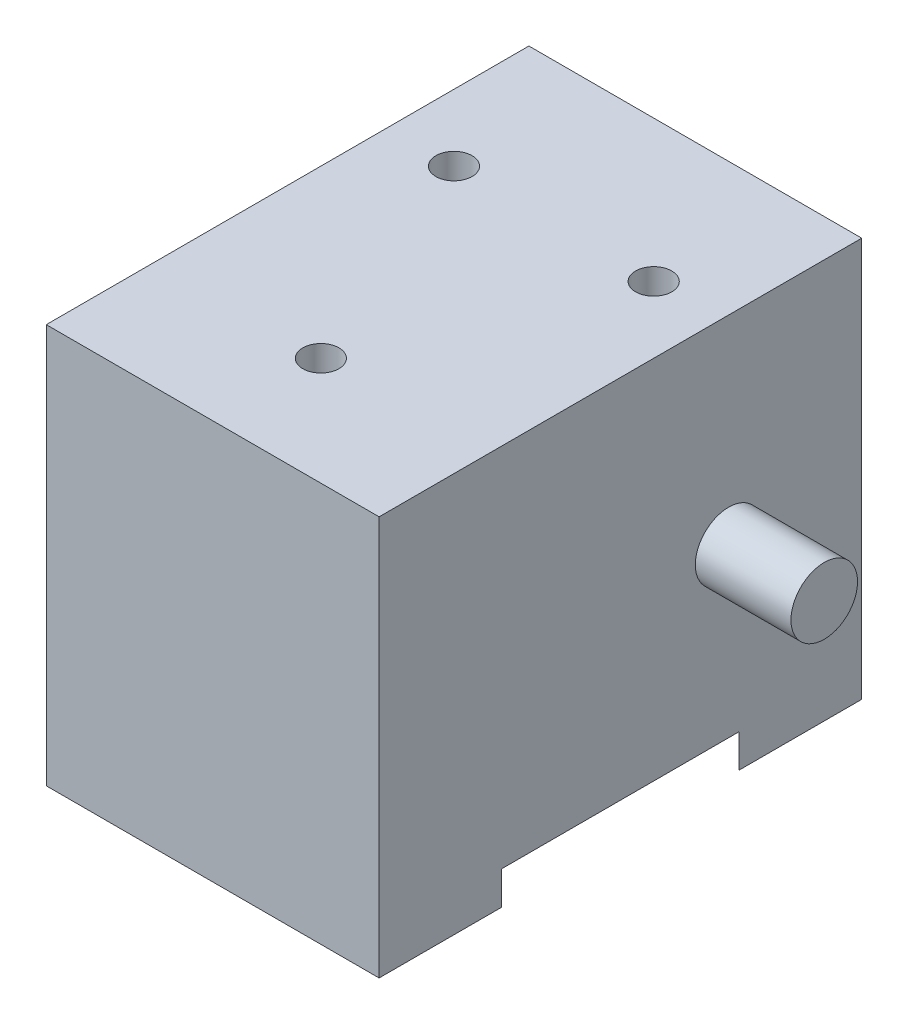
from build123d import *

# Parameters (mm, degrees)
SKETCH1_W                 = 31.75
SKETCH1_H                 = 46.0375
BOSS_EXTRUDE1_DEPTH       = 38.1
F_5_CLEARANCE_HOLE1_D     = 3.4544
F_5_CLEARANCE_HOLE1_DEPTH = 19.05
F_5_CLEARANCE_HOLE1_TIP   = 1.037806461
CUT_EXTRUDE1_DEPTH        = 3.175
SKETCH4_R                 = 3.175
BOSS_EXTRUDE2_DEPTH       = 25


with BuildPart() as part:
    # Sketch1 → Boss-Extrude1 (new body)
    with BuildSketch(Plane(origin=(0, 0, 0), x_dir=(1, 0, 0), z_dir=(0, 1, 0))):
        Rectangle(SKETCH1_W, SKETCH1_H)
    extrude(amount=BOSS_EXTRUDE1_DEPTH)

    # 5 Clearance Hole1
    with Locations(Plane(origin=(-9.525, 38.1, -9.52373), x_dir=(0, 0, 1), z_dir=(0, 1, 0))):
        with Locations((0, 0), (0, 19.05), (22.225, 9.525)):
            Hole(F_5_CLEARANCE_HOLE1_D / 2, depth=F_5_CLEARANCE_HOLE1_DEPTH)
            with Locations((0, 0, -(F_5_CLEARANCE_HOLE1_DEPTH + F_5_CLEARANCE_HOLE1_TIP / 2))):  # 118° drill point
                Cone(0, F_5_CLEARANCE_HOLE1_D / 2, F_5_CLEARANCE_HOLE1_TIP, mode=Mode.SUBTRACT)

    # Sketch3 → Cut-Extrude1 (cut)
    with BuildSketch(Plane.XZ):
        with BuildLine():
            Line((-15.875, 11.324061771), (-15.875, -11.324061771))
            ThreePointArc((-15.875, -11.324061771), (0, -19.5), (15.875, -11.324061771))
            Line((15.875, -11.324061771), (15.875, 11.324061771))
            ThreePointArc((15.875, 11.324061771), (0, 19.5), (-15.875, 11.324061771))
        make_face()
    extrude(amount=-CUT_EXTRUDE1_DEPTH, mode=Mode.SUBTRACT)

    # Sketch4 → Boss-Extrude2 (add, symmetric)
    with BuildSketch(Plane(origin=(0, 0, 0), x_dir=(0, 0, -1), z_dir=(1, 0, 0))):
        with Locations((10.31875, 19.05)):
            Circle(SKETCH4_R)
    extrude(amount=BOSS_EXTRUDE2_DEPTH, both=True)


solid = part.part
